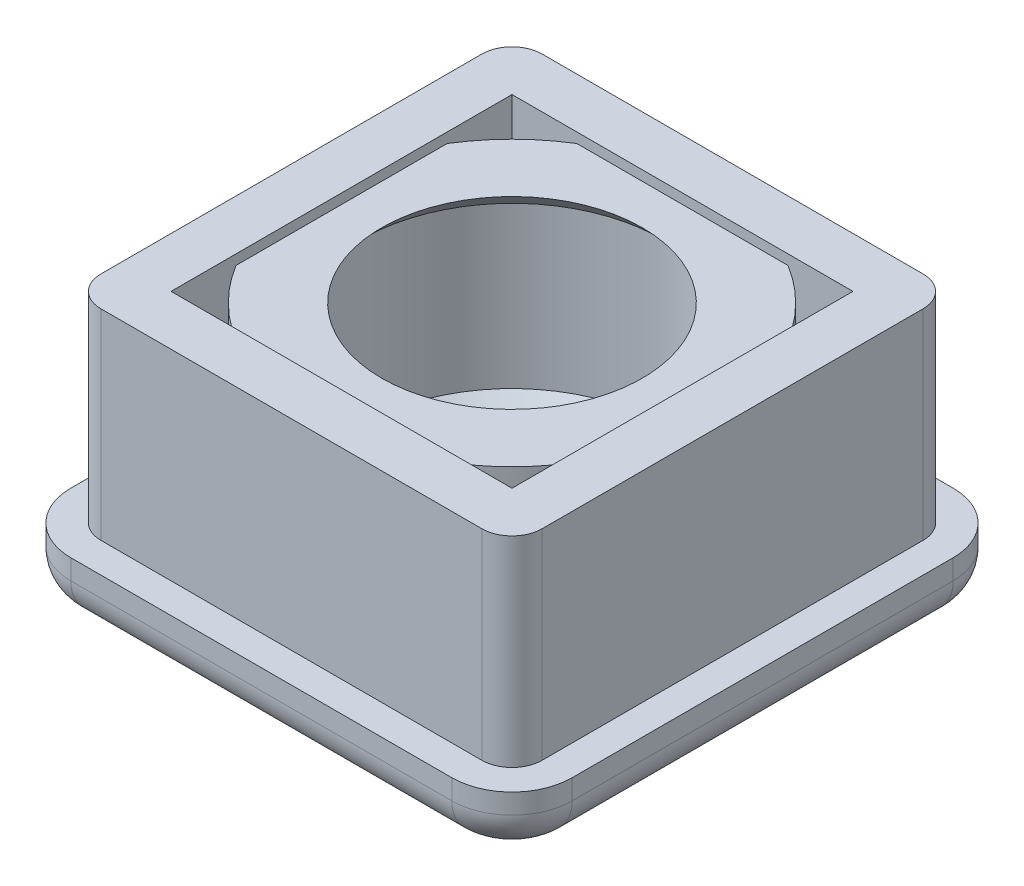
ISO-10303-21;
HEADER;
FILE_DESCRIPTION(('STEP AP214'),'2;1');
FILE_NAME('part.step','',(''),(''),'','','');
FILE_SCHEMA(('AUTOMOTIVE_DESIGN { 1 0 10303 214 1 1 1 1 }'));
ENDSEC;
DATA;
#1=APPLICATION_CONTEXT('core data for automotive mechanical design processes');
#2=APPLICATION_PROTOCOL_DEFINITION('international standard','automotive_design',2000,#1);
#3=PRODUCT_CONTEXT('',#1,'mechanical');
#4=PRODUCT('Part','Part','',(#3));
#5=PRODUCT_RELATED_PRODUCT_CATEGORY('part','',(#4));
#6=PRODUCT_DEFINITION_FORMATION('','',#4);
#7=PRODUCT_DEFINITION_CONTEXT('part definition',#1,'design');
#8=PRODUCT_DEFINITION('design','',#6,#7);
#9=PRODUCT_DEFINITION_SHAPE('','',#8);
#10=(LENGTH_UNIT() NAMED_UNIT(*) SI_UNIT(.MILLI.,.METRE.));
#11=(NAMED_UNIT(*) PLANE_ANGLE_UNIT() SI_UNIT($,.RADIAN.));
#12=(NAMED_UNIT(*) SI_UNIT($,.STERADIAN.) SOLID_ANGLE_UNIT());
#13=UNCERTAINTY_MEASURE_WITH_UNIT(LENGTH_MEASURE(1.E-05),#10,'distance_accuracy_value','');
#14=(GEOMETRIC_REPRESENTATION_CONTEXT(3) GLOBAL_UNCERTAINTY_ASSIGNED_CONTEXT((#13)) GLOBAL_UNIT_ASSIGNED_CONTEXT((#10,
#11,#12)) REPRESENTATION_CONTEXT('',''));
#15=CARTESIAN_POINT('',(0.,0.,0.));
#16=DIRECTION('',(0.,0.,1.));
#17=DIRECTION('',(1.,0.,0.));
#18=AXIS2_PLACEMENT_3D('',#15,#16,#17);
#19=CARTESIAN_POINT('',(0.,12.5,0.));
#20=DIRECTION('',(0.,-1.,0.));
#21=DIRECTION('',(0.,0.,-1.));
#22=AXIS2_PLACEMENT_3D('',#19,#20,#21);
#23=CYLINDRICAL_SURFACE('',#22,7.5);
#24=CARTESIAN_POINT('',(0.,3.5,0.));
#25=DIRECTION('',(0.,1.,0.));
#26=DIRECTION('',(0.,0.,1.));
#27=AXIS2_PLACEMENT_3D('',#24,#25,#26);
#28=CIRCLE('',#27,7.5);
#29=CARTESIAN_POINT('',(0.,3.5,7.5));
#30=VERTEX_POINT('',#29);
#31=EDGE_CURVE('E269',#30,#30,#28,.F.);
#32=ORIENTED_EDGE('',*,*,#31,.T.);
#33=EDGE_LOOP('',(#32));
#34=FACE_BOUND('',#33,.T.);
#35=CARTESIAN_POINT('',(0.,11.5,0.));
#36=DIRECTION('',(0.,1.,0.));
#37=DIRECTION('',(0.,0.,1.));
#38=AXIS2_PLACEMENT_3D('',#35,#36,#37);
#39=CIRCLE('',#38,7.5);
#40=CARTESIAN_POINT('',(0.,11.5,7.5));
#41=VERTEX_POINT('',#40);
#42=EDGE_CURVE('E342',#41,#41,#39,.T.);
#43=ORIENTED_EDGE('',*,*,#42,.T.);
#44=EDGE_LOOP('',(#43));
#45=FACE_BOUND('',#44,.T.);
#46=ADVANCED_FACE('F30',(#34,#45),#23,.F.);
#47=CARTESIAN_POINT('',(9.50000000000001,2.5,9.50000000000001));
#48=DIRECTION('',(0.,1.,0.));
#49=DIRECTION('',(0.,0.,1.));
#50=AXIS2_PLACEMENT_3D('',#47,#48,#49);
#51=PLANE('',#50);
#52=DIRECTION('',(-1.,0.,0.));
#53=VECTOR('',#52,1.);
#54=CARTESIAN_POINT('',(9.50000000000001,2.5,8.5));
#55=LINE('',#54,#53);
#56=CARTESIAN_POINT('',(-5.26782687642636,2.5,8.5));
#57=VERTEX_POINT('',#56);
#58=CARTESIAN_POINT('',(-8.49999999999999,2.5,8.5));
#59=VERTEX_POINT('',#58);
#60=EDGE_CURVE('E399',#57,#59,#55,.T.);
#61=ORIENTED_EDGE('',*,*,#60,.F.);
#62=CARTESIAN_POINT('',(0.,2.5,0.));
#63=DIRECTION('',(0.,1.,0.));
#64=DIRECTION('',(0.,0.,1.));
#65=AXIS2_PLACEMENT_3D('',#62,#63,#64);
#66=CIRCLE('',#65,10.);
#67=CARTESIAN_POINT('',(-8.49999999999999,2.5,5.26782687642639));
#68=VERTEX_POINT('',#67);
#69=EDGE_CURVE('E278',#68,#57,#66,.T.);
#70=ORIENTED_EDGE('',*,*,#69,.F.);
#71=DIRECTION('',(0.,0.,-1.));
#72=VECTOR('',#71,1.);
#73=CARTESIAN_POINT('',(-8.49999999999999,2.5,9.50000000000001));
#74=LINE('',#73,#72);
#75=EDGE_CURVE('E402',#59,#68,#74,.T.);
#76=ORIENTED_EDGE('',*,*,#75,.F.);
#77=EDGE_LOOP('',(#61,#70,#76));
#78=FACE_BOUND('',#77,.T.);
#79=ADVANCED_FACE('F509',(#78),#51,.T.);
#80=CARTESIAN_POINT('',(-8.49999999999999,2.5,-5.26782687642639));
#81=VERTEX_POINT('',#80);
#82=CARTESIAN_POINT('',(-8.49999999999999,2.5,-8.5));
#83=VERTEX_POINT('',#82);
#84=EDGE_CURVE('E401',#81,#83,#74,.T.);
#85=ORIENTED_EDGE('',*,*,#84,.F.);
#86=CARTESIAN_POINT('',(-5.26782687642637,2.5,-8.5));
#87=VERTEX_POINT('',#86);
#88=EDGE_CURVE('E542',#87,#81,#66,.T.);
#89=ORIENTED_EDGE('',*,*,#88,.F.);
#90=DIRECTION('',(1.,0.,0.));
#91=VECTOR('',#90,1.);
#92=CARTESIAN_POINT('',(9.50000000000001,2.5,-8.5));
#93=LINE('',#92,#91);
#94=EDGE_CURVE('E406',#83,#87,#93,.T.);
#95=ORIENTED_EDGE('',*,*,#94,.F.);
#96=EDGE_LOOP('',(#85,#89,#95));
#97=FACE_BOUND('',#96,.T.);
#98=ADVANCED_FACE('F547',(#97),#51,.T.);
#99=CARTESIAN_POINT('',(5.26782687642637,2.5,-8.5));
#100=VERTEX_POINT('',#99);
#101=CARTESIAN_POINT('',(8.50000000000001,2.5,-8.5));
#102=VERTEX_POINT('',#101);
#103=EDGE_CURVE('E405',#100,#102,#93,.T.);
#104=ORIENTED_EDGE('',*,*,#103,.F.);
#105=CARTESIAN_POINT('',(8.50000000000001,2.5,-5.26782687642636));
#106=VERTEX_POINT('',#105);
#107=EDGE_CURVE('E353',#106,#100,#66,.T.);
#108=ORIENTED_EDGE('',*,*,#107,.F.);
#109=DIRECTION('',(0.,0.,1.));
#110=VECTOR('',#109,1.);
#111=CARTESIAN_POINT('',(8.50000000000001,2.5,9.50000000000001));
#112=LINE('',#111,#110);
#113=EDGE_CURVE('E396',#102,#106,#112,.T.);
#114=ORIENTED_EDGE('',*,*,#113,.F.);
#115=EDGE_LOOP('',(#104,#108,#114));
#116=FACE_BOUND('',#115,.T.);
#117=ADVANCED_FACE('F530',(#116),#51,.T.);
#118=CARTESIAN_POINT('',(8.50000000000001,2.5,5.26782687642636));
#119=VERTEX_POINT('',#118);
#120=CARTESIAN_POINT('',(8.50000000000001,2.5,8.5));
#121=VERTEX_POINT('',#120);
#122=EDGE_CURVE('E382',#119,#121,#112,.T.);
#123=ORIENTED_EDGE('',*,*,#122,.F.);
#124=CARTESIAN_POINT('',(5.26782687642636,2.5,8.5));
#125=VERTEX_POINT('',#124);
#126=EDGE_CURVE('E351',#125,#119,#66,.T.);
#127=ORIENTED_EDGE('',*,*,#126,.F.);
#128=EDGE_CURVE('E268',#121,#125,#55,.T.);
#129=ORIENTED_EDGE('',*,*,#128,.F.);
#130=EDGE_LOOP('',(#123,#127,#129));
#131=FACE_BOUND('',#130,.T.);
#132=ADVANCED_FACE('F554',(#131),#51,.T.);
#133=CARTESIAN_POINT('',(8.50000000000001,13.,9.49999999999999));
#134=DIRECTION('',(-1.,0.,0.));
#135=DIRECTION('',(0.,0.,1.));
#136=AXIS2_PLACEMENT_3D('',#133,#134,#135);
#137=PLANE('',#136);
#138=ORIENTED_EDGE('',*,*,#113,.T.);
#139=DIRECTION('',(0.,-1.,0.));
#140=VECTOR('',#139,1.);
#141=CARTESIAN_POINT('',(8.50000000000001,12.5,-5.26782687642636));
#142=LINE('',#141,#140);
#143=CARTESIAN_POINT('',(8.50000000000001,12.5,-5.26782687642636));
#144=VERTEX_POINT('',#143);
#145=EDGE_CURVE('E366',#106,#144,#142,.F.);
#146=ORIENTED_EDGE('',*,*,#145,.T.);
#147=DIRECTION('',(0.,0.,-1.));
#148=VECTOR('',#147,1.);
#149=CARTESIAN_POINT('',(8.50000000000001,12.5,9.49999999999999));
#150=LINE('',#149,#148);
#151=CARTESIAN_POINT('',(8.50000000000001,12.5,5.26782687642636));
#152=VERTEX_POINT('',#151);
#153=EDGE_CURVE('E373',#152,#144,#150,.T.);
#154=ORIENTED_EDGE('',*,*,#153,.F.);
#155=DIRECTION('',(0.,-1.,0.));
#156=VECTOR('',#155,1.);
#157=CARTESIAN_POINT('',(8.50000000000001,12.5,5.26782687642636));
#158=LINE('',#157,#156);
#159=EDGE_CURVE('E260',#152,#119,#158,.T.);
#160=ORIENTED_EDGE('',*,*,#159,.T.);
#161=ORIENTED_EDGE('',*,*,#122,.T.);
#162=DIRECTION('',(0.,-1.,0.));
#163=VECTOR('',#162,1.);
#164=CARTESIAN_POINT('',(8.50000000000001,13.,8.5));
#165=LINE('',#164,#163);
#166=CARTESIAN_POINT('',(8.50000000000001,13.,8.5));
#167=VERTEX_POINT('',#166);
#168=EDGE_CURVE('E379',#167,#121,#165,.T.);
#169=ORIENTED_EDGE('',*,*,#168,.F.);
#170=DIRECTION('',(0.,0.,-1.));
#171=VECTOR('',#170,1.);
#172=CARTESIAN_POINT('',(8.50000000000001,13.,9.49999999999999));
#173=LINE('',#172,#171);
#174=CARTESIAN_POINT('',(8.50000000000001,13.,-8.5));
#175=VERTEX_POINT('',#174);
#176=EDGE_CURVE('E375',#167,#175,#173,.T.);
#177=ORIENTED_EDGE('',*,*,#176,.T.);
#178=DIRECTION('',(0.,-1.,0.));
#179=VECTOR('',#178,1.);
#180=CARTESIAN_POINT('',(8.50000000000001,13.,-8.5));
#181=LINE('',#180,#179);
#182=EDGE_CURVE('E376',#175,#102,#181,.T.);
#183=ORIENTED_EDGE('',*,*,#182,.T.);
#184=EDGE_LOOP('',(#138,#146,#154,#160,#161,#169,#177,#183));
#185=FACE_BOUND('',#184,.T.);
#186=ADVANCED_FACE('F522',(#185),#137,.T.);
#187=CARTESIAN_POINT('',(9.5,13.,-8.5));
#188=DIRECTION('',(0.,0.,1.));
#189=DIRECTION('',(1.,0.,0.));
#190=AXIS2_PLACEMENT_3D('',#187,#188,#189);
#191=PLANE('',#190);
#192=ORIENTED_EDGE('',*,*,#94,.T.);
#193=DIRECTION('',(0.,-1.,0.));
#194=VECTOR('',#193,1.);
#195=CARTESIAN_POINT('',(-5.26782687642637,12.5,-8.5));
#196=LINE('',#195,#194);
#197=CARTESIAN_POINT('',(-5.26782687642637,12.5,-8.5));
#198=VERTEX_POINT('',#197);
#199=EDGE_CURVE('E362',#87,#198,#196,.F.);
#200=ORIENTED_EDGE('',*,*,#199,.T.);
#201=DIRECTION('',(-1.,0.,0.));
#202=VECTOR('',#201,1.);
#203=CARTESIAN_POINT('',(9.5,12.5,-8.5));
#204=LINE('',#203,#202);
#205=CARTESIAN_POINT('',(5.26782687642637,12.5,-8.5));
#206=VERTEX_POINT('',#205);
#207=EDGE_CURVE('E371',#206,#198,#204,.T.);
#208=ORIENTED_EDGE('',*,*,#207,.F.);
#209=DIRECTION('',(0.,-1.,0.));
#210=VECTOR('',#209,1.);
#211=CARTESIAN_POINT('',(5.26782687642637,12.5,-8.5));
#212=LINE('',#211,#210);
#213=EDGE_CURVE('E359',#206,#100,#212,.T.);
#214=ORIENTED_EDGE('',*,*,#213,.T.);
#215=ORIENTED_EDGE('',*,*,#103,.T.);
#216=ORIENTED_EDGE('',*,*,#182,.F.);
#217=DIRECTION('',(-1.,0.,0.));
#218=VECTOR('',#217,1.);
#219=CARTESIAN_POINT('',(9.5,13.,-8.5));
#220=LINE('',#219,#218);
#221=CARTESIAN_POINT('',(-8.49999999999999,13.,-8.5));
#222=VERTEX_POINT('',#221);
#223=EDGE_CURVE('E390',#175,#222,#220,.T.);
#224=ORIENTED_EDGE('',*,*,#223,.T.);
#225=DIRECTION('',(0.,-1.,0.));
#226=VECTOR('',#225,1.);
#227=CARTESIAN_POINT('',(-8.49999999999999,13.,-8.5));
#228=LINE('',#227,#226);
#229=EDGE_CURVE('E380',#222,#83,#228,.T.);
#230=ORIENTED_EDGE('',*,*,#229,.T.);
#231=EDGE_LOOP('',(#192,#200,#208,#214,#215,#216,#224,#230));
#232=FACE_BOUND('',#231,.T.);
#233=ADVANCED_FACE('F524',(#232),#191,.T.);
#234=CARTESIAN_POINT('',(-8.49999999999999,13.,-9.49999999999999));
#235=DIRECTION('',(1.,0.,0.));
#236=DIRECTION('',(0.,0.,-1.));
#237=AXIS2_PLACEMENT_3D('',#234,#235,#236);
#238=PLANE('',#237);
#239=ORIENTED_EDGE('',*,*,#75,.T.);
#240=DIRECTION('',(0.,-1.,0.));
#241=VECTOR('',#240,1.);
#242=CARTESIAN_POINT('',(-8.49999999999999,12.5,5.26782687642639));
#243=LINE('',#242,#241);
#244=CARTESIAN_POINT('',(-8.49999999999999,12.5,5.26782687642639));
#245=VERTEX_POINT('',#244);
#246=EDGE_CURVE('E356',#68,#245,#243,.F.);
#247=ORIENTED_EDGE('',*,*,#246,.T.);
#248=DIRECTION('',(0.,0.,1.));
#249=VECTOR('',#248,1.);
#250=CARTESIAN_POINT('',(-8.49999999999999,12.5,-9.49999999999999));
#251=LINE('',#250,#249);
#252=CARTESIAN_POINT('',(-8.49999999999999,12.5,-5.26782687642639));
#253=VERTEX_POINT('',#252);
#254=EDGE_CURVE('E369',#253,#245,#251,.T.);
#255=ORIENTED_EDGE('',*,*,#254,.F.);
#256=DIRECTION('',(0.,-1.,0.));
#257=VECTOR('',#256,1.);
#258=CARTESIAN_POINT('',(-8.49999999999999,12.5,-5.26782687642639));
#259=LINE('',#258,#257);
#260=EDGE_CURVE('E261',#253,#81,#259,.T.);
#261=ORIENTED_EDGE('',*,*,#260,.T.);
#262=ORIENTED_EDGE('',*,*,#84,.T.);
#263=ORIENTED_EDGE('',*,*,#229,.F.);
#264=DIRECTION('',(0.,0.,1.));
#265=VECTOR('',#264,1.);
#266=CARTESIAN_POINT('',(-8.49999999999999,13.,-9.49999999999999));
#267=LINE('',#266,#265);
#268=CARTESIAN_POINT('',(-8.49999999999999,13.,8.5));
#269=VERTEX_POINT('',#268);
#270=EDGE_CURVE('E393',#222,#269,#267,.T.);
#271=ORIENTED_EDGE('',*,*,#270,.T.);
#272=DIRECTION('',(0.,-1.,0.));
#273=VECTOR('',#272,1.);
#274=CARTESIAN_POINT('',(-8.49999999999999,13.,8.5));
#275=LINE('',#274,#273);
#276=EDGE_CURVE('E385',#269,#59,#275,.T.);
#277=ORIENTED_EDGE('',*,*,#276,.T.);
#278=EDGE_LOOP('',(#239,#247,#255,#261,#262,#263,#271,#277));
#279=FACE_BOUND('',#278,.T.);
#280=ADVANCED_FACE('F511',(#279),#238,.T.);
#281=CARTESIAN_POINT('',(-9.49999999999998,13.,8.5));
#282=DIRECTION('',(0.,0.,-1.));
#283=DIRECTION('',(-1.,0.,0.));
#284=AXIS2_PLACEMENT_3D('',#281,#282,#283);
#285=PLANE('',#284);
#286=ORIENTED_EDGE('',*,*,#128,.T.);
#287=DIRECTION('',(0.,-1.,0.));
#288=VECTOR('',#287,1.);
#289=CARTESIAN_POINT('',(5.26782687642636,12.5,8.5));
#290=LINE('',#289,#288);
#291=CARTESIAN_POINT('',(5.26782687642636,12.5,8.5));
#292=VERTEX_POINT('',#291);
#293=EDGE_CURVE('E253',#125,#292,#290,.F.);
#294=ORIENTED_EDGE('',*,*,#293,.T.);
#295=DIRECTION('',(1.,0.,0.));
#296=VECTOR('',#295,1.);
#297=CARTESIAN_POINT('',(-9.49999999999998,12.5,8.5));
#298=LINE('',#297,#296);
#299=CARTESIAN_POINT('',(-5.26782687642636,12.5,8.5));
#300=VERTEX_POINT('',#299);
#301=EDGE_CURVE('E242',#300,#292,#298,.T.);
#302=ORIENTED_EDGE('',*,*,#301,.F.);
#303=DIRECTION('',(0.,-1.,0.));
#304=VECTOR('',#303,1.);
#305=CARTESIAN_POINT('',(-5.26782687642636,12.5,8.5));
#306=LINE('',#305,#304);
#307=EDGE_CURVE('E254',#300,#57,#306,.T.);
#308=ORIENTED_EDGE('',*,*,#307,.T.);
#309=ORIENTED_EDGE('',*,*,#60,.T.);
#310=ORIENTED_EDGE('',*,*,#276,.F.);
#311=DIRECTION('',(1.,0.,0.));
#312=VECTOR('',#311,1.);
#313=CARTESIAN_POINT('',(-9.49999999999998,13.,8.5));
#314=LINE('',#313,#312);
#315=EDGE_CURVE('E388',#269,#167,#314,.T.);
#316=ORIENTED_EDGE('',*,*,#315,.T.);
#317=ORIENTED_EDGE('',*,*,#168,.T.);
#318=EDGE_LOOP('',(#286,#294,#302,#308,#309,#310,#316,#317));
#319=FACE_BOUND('',#318,.T.);
#320=ADVANCED_FACE('F265',(#319),#285,.T.);
#321=CARTESIAN_POINT('',(9.50000000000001,3.,9.50000000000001));
#322=DIRECTION('',(0.,1.,0.));
#323=DIRECTION('',(0.,0.,1.));
#324=AXIS2_PLACEMENT_3D('',#321,#322,#323);
#325=PLANE('',#324);
#326=CARTESIAN_POINT('',(9.50000000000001,3.,9.50000000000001));
#327=DIRECTION('',(0.,1.,0.));
#328=DIRECTION('',(0.,0.,1.));
#329=AXIS2_PLACEMENT_3D('',#326,#327,#328);
#330=CIRCLE('',#329,3.);
#331=CARTESIAN_POINT('',(9.49999999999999,3.,12.5));
#332=VERTEX_POINT('',#331);
#333=CARTESIAN_POINT('',(12.5,3.,9.49999999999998));
#334=VERTEX_POINT('',#333);
#335=EDGE_CURVE('E466',#332,#334,#330,.T.);
#336=ORIENTED_EDGE('',*,*,#335,.T.);
#337=DIRECTION('',(0.,0.,-1.));
#338=VECTOR('',#337,1.);
#339=CARTESIAN_POINT('',(12.5,3.,9.49999999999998));
#340=LINE('',#339,#338);
#341=CARTESIAN_POINT('',(12.5,3.,-9.49999999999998));
#342=VERTEX_POINT('',#341);
#343=EDGE_CURVE('E469',#334,#342,#340,.T.);
#344=ORIENTED_EDGE('',*,*,#343,.T.);
#345=CARTESIAN_POINT('',(9.50000000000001,3.,-9.5));
#346=DIRECTION('',(0.,1.,0.));
#347=DIRECTION('',(0.,0.,-1.));
#348=AXIS2_PLACEMENT_3D('',#345,#346,#347);
#349=CIRCLE('',#348,3.);
#350=CARTESIAN_POINT('',(9.49999999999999,3.,-12.5));
#351=VERTEX_POINT('',#350);
#352=EDGE_CURVE('E471',#342,#351,#349,.T.);
#353=ORIENTED_EDGE('',*,*,#352,.T.);
#354=DIRECTION('',(-1.,0.,0.));
#355=VECTOR('',#354,1.);
#356=CARTESIAN_POINT('',(-9.49999999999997,3.,-12.5));
#357=LINE('',#356,#355);
#358=CARTESIAN_POINT('',(-9.49999999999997,3.,-12.5));
#359=VERTEX_POINT('',#358);
#360=EDGE_CURVE('E473',#351,#359,#357,.T.);
#361=ORIENTED_EDGE('',*,*,#360,.T.);
#362=CARTESIAN_POINT('',(-9.49999999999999,3.,-9.5));
#363=DIRECTION('',(0.,1.,0.));
#364=DIRECTION('',(0.,0.,-1.));
#365=AXIS2_PLACEMENT_3D('',#362,#363,#364);
#366=CIRCLE('',#365,3.);
#367=CARTESIAN_POINT('',(-12.5,3.,-9.49999999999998));
#368=VERTEX_POINT('',#367);
#369=EDGE_CURVE('E475',#359,#368,#366,.T.);
#370=ORIENTED_EDGE('',*,*,#369,.T.);
#371=DIRECTION('',(0.,0.,1.));
#372=VECTOR('',#371,1.);
#373=CARTESIAN_POINT('',(-12.5,3.,9.49999999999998));
#374=LINE('',#373,#372);
#375=CARTESIAN_POINT('',(-12.5,3.,9.49999999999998));
#376=VERTEX_POINT('',#375);
#377=EDGE_CURVE('E477',#368,#376,#374,.T.);
#378=ORIENTED_EDGE('',*,*,#377,.T.);
#379=CARTESIAN_POINT('',(-9.49999999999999,3.,9.50000000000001));
#380=DIRECTION('',(0.,1.,0.));
#381=DIRECTION('',(0.,0.,-1.));
#382=AXIS2_PLACEMENT_3D('',#379,#380,#381);
#383=CIRCLE('',#382,3.);
#384=CARTESIAN_POINT('',(-9.49999999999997,3.,12.5));
#385=VERTEX_POINT('',#384);
#386=EDGE_CURVE('E479',#376,#385,#383,.T.);
#387=ORIENTED_EDGE('',*,*,#386,.T.);
#388=DIRECTION('',(1.,0.,0.));
#389=VECTOR('',#388,1.);
#390=CARTESIAN_POINT('',(-9.49999999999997,3.,12.5));
#391=LINE('',#390,#389);
#392=EDGE_CURVE('E481',#385,#332,#391,.T.);
#393=ORIENTED_EDGE('',*,*,#392,.T.);
#394=EDGE_LOOP('',(#336,#344,#353,#361,#370,#378,#387,#393));
#395=FACE_BOUND('',#394,.T.);
#396=DIRECTION('',(0.,0.,-1.));
#397=VECTOR('',#396,1.);
#398=CARTESIAN_POINT('',(11.,3.,9.49999999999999));
#399=LINE('',#398,#397);
#400=CARTESIAN_POINT('',(11.,3.,9.49999999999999));
#401=VERTEX_POINT('',#400);
#402=CARTESIAN_POINT('',(11.,3.,-9.49999999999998));
#403=VERTEX_POINT('',#402);
#404=EDGE_CURVE('E431',#401,#403,#399,.T.);
#405=ORIENTED_EDGE('',*,*,#404,.F.);
#406=CARTESIAN_POINT('',(9.50000000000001,3.,9.50000000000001));
#407=DIRECTION('',(0.,1.,0.));
#408=DIRECTION('',(0.,0.,1.));
#409=AXIS2_PLACEMENT_3D('',#406,#407,#408);
#410=CIRCLE('',#409,1.5);
#411=CARTESIAN_POINT('',(9.5,3.,11.));
#412=VERTEX_POINT('',#411);
#413=EDGE_CURVE('E409',#412,#401,#410,.T.);
#414=ORIENTED_EDGE('',*,*,#413,.F.);
#415=DIRECTION('',(1.,0.,0.));
#416=VECTOR('',#415,1.);
#417=CARTESIAN_POINT('',(-9.49999999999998,3.,11.));
#418=LINE('',#417,#416);
#419=CARTESIAN_POINT('',(-9.49999999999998,3.,11.));
#420=VERTEX_POINT('',#419);
#421=EDGE_CURVE('E414',#420,#412,#418,.T.);
#422=ORIENTED_EDGE('',*,*,#421,.F.);
#423=CARTESIAN_POINT('',(-9.49999999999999,3.,9.50000000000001));
#424=DIRECTION('',(0.,1.,0.));
#425=DIRECTION('',(0.,0.,1.));
#426=AXIS2_PLACEMENT_3D('',#423,#424,#425);
#427=CIRCLE('',#426,1.5);
#428=CARTESIAN_POINT('',(-11.,3.,9.49999999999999));
#429=VERTEX_POINT('',#428);
#430=EDGE_CURVE('E441',#429,#420,#427,.T.);
#431=ORIENTED_EDGE('',*,*,#430,.F.);
#432=DIRECTION('',(0.,0.,1.));
#433=VECTOR('',#432,1.);
#434=CARTESIAN_POINT('',(-11.,3.,-9.49999999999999));
#435=LINE('',#434,#433);
#436=CARTESIAN_POINT('',(-11.,3.,-9.49999999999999));
#437=VERTEX_POINT('',#436);
#438=EDGE_CURVE('E439',#437,#429,#435,.T.);
#439=ORIENTED_EDGE('',*,*,#438,.F.);
#440=CARTESIAN_POINT('',(-9.49999999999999,3.,-9.5));
#441=DIRECTION('',(0.,1.,0.));
#442=DIRECTION('',(0.,0.,1.));
#443=AXIS2_PLACEMENT_3D('',#440,#441,#442);
#444=CIRCLE('',#443,1.5);
#445=CARTESIAN_POINT('',(-9.49999999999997,3.,-11.));
#446=VERTEX_POINT('',#445);
#447=EDGE_CURVE('E437',#446,#437,#444,.T.);
#448=ORIENTED_EDGE('',*,*,#447,.F.);
#449=DIRECTION('',(-1.,0.,0.));
#450=VECTOR('',#449,1.);
#451=CARTESIAN_POINT('',(9.5,3.,-11.));
#452=LINE('',#451,#450);
#453=CARTESIAN_POINT('',(9.5,3.,-11.));
#454=VERTEX_POINT('',#453);
#455=EDGE_CURVE('E435',#454,#446,#452,.T.);
#456=ORIENTED_EDGE('',*,*,#455,.F.);
#457=CARTESIAN_POINT('',(9.50000000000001,3.,-9.5));
#458=DIRECTION('',(0.,1.,0.));
#459=DIRECTION('',(0.,0.,1.));
#460=AXIS2_PLACEMENT_3D('',#457,#458,#459);
#461=CIRCLE('',#460,1.5);
#462=EDGE_CURVE('E433',#403,#454,#461,.T.);
#463=ORIENTED_EDGE('',*,*,#462,.F.);
#464=EDGE_LOOP('',(#405,#414,#422,#431,#439,#448,#456,#463));
#465=FACE_BOUND('',#464,.T.);
#466=ADVANCED_FACE('F728',(#395,#465),#325,.T.);
#467=CARTESIAN_POINT('',(9.50000000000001,3.,9.50000000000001));
#468=DIRECTION('',(0.,-1.,0.));
#469=DIRECTION('',(0.,0.,-1.));
#470=AXIS2_PLACEMENT_3D('',#467,#468,#469);
#471=CYLINDRICAL_SURFACE('',#470,3.);
#472=DIRECTION('',(0.,-1.,0.));
#473=VECTOR('',#472,1.);
#474=CARTESIAN_POINT('',(9.49999999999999,3.,12.5));
#475=LINE('',#474,#473);
#476=CARTESIAN_POINT('',(9.49999999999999,2.,12.5));
#477=VERTEX_POINT('',#476);
#478=EDGE_CURVE('E483',#332,#477,#475,.T.);
#479=ORIENTED_EDGE('',*,*,#478,.T.);
#480=CARTESIAN_POINT('',(9.50000000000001,2.,9.50000000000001));
#481=DIRECTION('',(0.,1.,0.));
#482=DIRECTION('',(0.,0.,1.));
#483=AXIS2_PLACEMENT_3D('',#480,#481,#482);
#484=CIRCLE('',#483,3.);
#485=CARTESIAN_POINT('',(12.5,2.,9.49999999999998));
#486=VERTEX_POINT('',#485);
#487=EDGE_CURVE('E39',#477,#486,#484,.T.);
#488=ORIENTED_EDGE('',*,*,#487,.T.);
#489=DIRECTION('',(0.,-1.,0.));
#490=VECTOR('',#489,1.);
#491=CARTESIAN_POINT('',(12.5,3.,9.49999999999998));
#492=LINE('',#491,#490);
#493=EDGE_CURVE('E502',#334,#486,#492,.T.);
#494=ORIENTED_EDGE('',*,*,#493,.F.);
#495=ORIENTED_EDGE('',*,*,#335,.F.);
#496=EDGE_LOOP('',(#479,#488,#494,#495));
#497=FACE_BOUND('',#496,.T.);
#498=ADVANCED_FACE('F720',(#497),#471,.T.);
#499=CARTESIAN_POINT('',(12.5,3.,9.49999999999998));
#500=DIRECTION('',(-1.,0.,0.));
#501=DIRECTION('',(0.,0.,1.));
#502=AXIS2_PLACEMENT_3D('',#499,#500,#501);
#503=PLANE('',#502);
#504=ORIENTED_EDGE('',*,*,#493,.T.);
#505=DIRECTION('',(0.,0.,-1.));
#506=VECTOR('',#505,1.);
#507=CARTESIAN_POINT('',(12.5,2.,9.49999999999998));
#508=LINE('',#507,#506);
#509=CARTESIAN_POINT('',(12.5,2.,-9.49999999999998));
#510=VERTEX_POINT('',#509);
#511=EDGE_CURVE('E311',#486,#510,#508,.T.);
#512=ORIENTED_EDGE('',*,*,#511,.T.);
#513=DIRECTION('',(0.,-1.,0.));
#514=VECTOR('',#513,1.);
#515=CARTESIAN_POINT('',(12.5,3.,-9.49999999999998));
#516=LINE('',#515,#514);
#517=EDGE_CURVE('E499',#342,#510,#516,.T.);
#518=ORIENTED_EDGE('',*,*,#517,.F.);
#519=ORIENTED_EDGE('',*,*,#343,.F.);
#520=EDGE_LOOP('',(#504,#512,#518,#519));
#521=FACE_BOUND('',#520,.T.);
#522=ADVANCED_FACE('F712',(#521),#503,.F.);
#523=CARTESIAN_POINT('',(9.50000000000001,3.,-9.5));
#524=DIRECTION('',(0.,-1.,0.));
#525=DIRECTION('',(0.,0.,-1.));
#526=AXIS2_PLACEMENT_3D('',#523,#524,#525);
#527=CYLINDRICAL_SURFACE('',#526,3.);
#528=ORIENTED_EDGE('',*,*,#517,.T.);
#529=CARTESIAN_POINT('',(9.50000000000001,2.,-9.5));
#530=DIRECTION('',(0.,1.,0.));
#531=DIRECTION('',(0.,0.,1.));
#532=AXIS2_PLACEMENT_3D('',#529,#530,#531);
#533=CIRCLE('',#532,3.);
#534=CARTESIAN_POINT('',(9.49999999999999,2.,-12.5));
#535=VERTEX_POINT('',#534);
#536=EDGE_CURVE('E309',#510,#535,#533,.T.);
#537=ORIENTED_EDGE('',*,*,#536,.T.);
#538=DIRECTION('',(0.,-1.,0.));
#539=VECTOR('',#538,1.);
#540=CARTESIAN_POINT('',(9.49999999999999,3.,-12.5));
#541=LINE('',#540,#539);
#542=EDGE_CURVE('E496',#351,#535,#541,.T.);
#543=ORIENTED_EDGE('',*,*,#542,.F.);
#544=ORIENTED_EDGE('',*,*,#352,.F.);
#545=EDGE_LOOP('',(#528,#537,#543,#544));
#546=FACE_BOUND('',#545,.T.);
#547=ADVANCED_FACE('F704',(#546),#527,.T.);
#548=CARTESIAN_POINT('',(-9.49999999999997,3.,-12.5));
#549=DIRECTION('',(0.,0.,1.));
#550=DIRECTION('',(1.,0.,0.));
#551=AXIS2_PLACEMENT_3D('',#548,#549,#550);
#552=PLANE('',#551);
#553=ORIENTED_EDGE('',*,*,#542,.T.);
#554=DIRECTION('',(-1.,0.,0.));
#555=VECTOR('',#554,1.);
#556=CARTESIAN_POINT('',(-9.49999999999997,2.,-12.5));
#557=LINE('',#556,#555);
#558=CARTESIAN_POINT('',(-9.49999999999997,2.,-12.5));
#559=VERTEX_POINT('',#558);
#560=EDGE_CURVE('E307',#535,#559,#557,.T.);
#561=ORIENTED_EDGE('',*,*,#560,.T.);
#562=DIRECTION('',(0.,-1.,0.));
#563=VECTOR('',#562,1.);
#564=CARTESIAN_POINT('',(-9.49999999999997,3.,-12.5));
#565=LINE('',#564,#563);
#566=EDGE_CURVE('E493',#359,#559,#565,.T.);
#567=ORIENTED_EDGE('',*,*,#566,.F.);
#568=ORIENTED_EDGE('',*,*,#360,.F.);
#569=EDGE_LOOP('',(#553,#561,#567,#568));
#570=FACE_BOUND('',#569,.T.);
#571=ADVANCED_FACE('F696',(#570),#552,.F.);
#572=CARTESIAN_POINT('',(-9.49999999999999,3.,-9.5));
#573=DIRECTION('',(0.,-1.,0.));
#574=DIRECTION('',(0.,0.,-1.));
#575=AXIS2_PLACEMENT_3D('',#572,#573,#574);
#576=CYLINDRICAL_SURFACE('',#575,3.);
#577=ORIENTED_EDGE('',*,*,#566,.T.);
#578=CARTESIAN_POINT('',(-9.49999999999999,2.,-9.5));
#579=DIRECTION('',(0.,1.,0.));
#580=DIRECTION('',(0.,0.,1.));
#581=AXIS2_PLACEMENT_3D('',#578,#579,#580);
#582=CIRCLE('',#581,3.);
#583=CARTESIAN_POINT('',(-12.5,2.,-9.49999999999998));
#584=VERTEX_POINT('',#583);
#585=EDGE_CURVE('E305',#559,#584,#582,.T.);
#586=ORIENTED_EDGE('',*,*,#585,.T.);
#587=DIRECTION('',(0.,-1.,0.));
#588=VECTOR('',#587,1.);
#589=CARTESIAN_POINT('',(-12.5,3.,-9.49999999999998));
#590=LINE('',#589,#588);
#591=EDGE_CURVE('E490',#368,#584,#590,.T.);
#592=ORIENTED_EDGE('',*,*,#591,.F.);
#593=ORIENTED_EDGE('',*,*,#369,.F.);
#594=EDGE_LOOP('',(#577,#586,#592,#593));
#595=FACE_BOUND('',#594,.T.);
#596=ADVANCED_FACE('F688',(#595),#576,.T.);
#597=CARTESIAN_POINT('',(-12.5,3.,9.49999999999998));
#598=DIRECTION('',(1.,0.,0.));
#599=DIRECTION('',(0.,0.,-1.));
#600=AXIS2_PLACEMENT_3D('',#597,#598,#599);
#601=PLANE('',#600);
#602=ORIENTED_EDGE('',*,*,#591,.T.);
#603=DIRECTION('',(0.,0.,1.));
#604=VECTOR('',#603,1.);
#605=CARTESIAN_POINT('',(-12.5,2.,9.49999999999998));
#606=LINE('',#605,#604);
#607=CARTESIAN_POINT('',(-12.5,2.,9.49999999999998));
#608=VERTEX_POINT('',#607);
#609=EDGE_CURVE('E303',#584,#608,#606,.T.);
#610=ORIENTED_EDGE('',*,*,#609,.T.);
#611=DIRECTION('',(0.,-1.,0.));
#612=VECTOR('',#611,1.);
#613=CARTESIAN_POINT('',(-12.5,3.,9.49999999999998));
#614=LINE('',#613,#612);
#615=EDGE_CURVE('E487',#376,#608,#614,.T.);
#616=ORIENTED_EDGE('',*,*,#615,.F.);
#617=ORIENTED_EDGE('',*,*,#377,.F.);
#618=EDGE_LOOP('',(#602,#610,#616,#617));
#619=FACE_BOUND('',#618,.T.);
#620=ADVANCED_FACE('F680',(#619),#601,.F.);
#621=CARTESIAN_POINT('',(-9.49999999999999,3.,9.50000000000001));
#622=DIRECTION('',(0.,-1.,0.));
#623=DIRECTION('',(0.,0.,-1.));
#624=AXIS2_PLACEMENT_3D('',#621,#622,#623);
#625=CYLINDRICAL_SURFACE('',#624,3.);
#626=ORIENTED_EDGE('',*,*,#615,.T.);
#627=CARTESIAN_POINT('',(-9.49999999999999,2.,9.50000000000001));
#628=DIRECTION('',(0.,1.,0.));
#629=DIRECTION('',(0.,0.,1.));
#630=AXIS2_PLACEMENT_3D('',#627,#628,#629);
#631=CIRCLE('',#630,3.);
#632=CARTESIAN_POINT('',(-9.49999999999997,2.,12.5));
#633=VERTEX_POINT('',#632);
#634=EDGE_CURVE('E283',#608,#633,#631,.T.);
#635=ORIENTED_EDGE('',*,*,#634,.T.);
#636=DIRECTION('',(0.,-1.,0.));
#637=VECTOR('',#636,1.);
#638=CARTESIAN_POINT('',(-9.49999999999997,3.,12.5));
#639=LINE('',#638,#637);
#640=EDGE_CURVE('E485',#385,#633,#639,.T.);
#641=ORIENTED_EDGE('',*,*,#640,.F.);
#642=ORIENTED_EDGE('',*,*,#386,.F.);
#643=EDGE_LOOP('',(#626,#635,#641,#642));
#644=FACE_BOUND('',#643,.T.);
#645=ADVANCED_FACE('F673',(#644),#625,.T.);
#646=CARTESIAN_POINT('',(-9.49999999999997,3.,12.5));
#647=DIRECTION('',(0.,0.,-1.));
#648=DIRECTION('',(-1.,0.,0.));
#649=AXIS2_PLACEMENT_3D('',#646,#647,#648);
#650=PLANE('',#649);
#651=ORIENTED_EDGE('',*,*,#640,.T.);
#652=DIRECTION('',(1.,0.,0.));
#653=VECTOR('',#652,1.);
#654=CARTESIAN_POINT('',(-9.49999999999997,2.,12.5));
#655=LINE('',#654,#653);
#656=EDGE_CURVE('E11',#633,#477,#655,.T.);
#657=ORIENTED_EDGE('',*,*,#656,.T.);
#658=ORIENTED_EDGE('',*,*,#478,.F.);
#659=ORIENTED_EDGE('',*,*,#392,.F.);
#660=EDGE_LOOP('',(#651,#657,#658,#659));
#661=FACE_BOUND('',#660,.T.);
#662=ADVANCED_FACE('F664',(#661),#650,.F.);
#663=CARTESIAN_POINT('',(9.50000000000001,0.,9.50000000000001));
#664=DIRECTION('',(0.,1.,0.));
#665=DIRECTION('',(0.,0.,1.));
#666=AXIS2_PLACEMENT_3D('',#663,#664,#665);
#667=PLANE('',#666);
#668=DIRECTION('',(1.,0.,0.));
#669=VECTOR('',#668,1.);
#670=CARTESIAN_POINT('',(9.50000000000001,0.,10.5));
#671=LINE('',#670,#669);
#672=CARTESIAN_POINT('',(9.5,0.,10.5));
#673=VERTEX_POINT('',#672);
#674=CARTESIAN_POINT('',(-9.49999999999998,0.,10.5));
#675=VERTEX_POINT('',#674);
#676=EDGE_CURVE('E286',#673,#675,#671,.F.);
#677=ORIENTED_EDGE('',*,*,#676,.T.);
#678=CARTESIAN_POINT('',(-9.49999999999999,0.,9.50000000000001));
#679=DIRECTION('',(0.,1.,0.));
#680=DIRECTION('',(0.,0.,1.));
#681=AXIS2_PLACEMENT_3D('',#678,#679,#680);
#682=CIRCLE('',#681,1.);
#683=CARTESIAN_POINT('',(-10.5,0.,9.5));
#684=VERTEX_POINT('',#683);
#685=EDGE_CURVE('E300',#675,#684,#682,.F.);
#686=ORIENTED_EDGE('',*,*,#685,.T.);
#687=DIRECTION('',(0.,0.,1.));
#688=VECTOR('',#687,1.);
#689=CARTESIAN_POINT('',(-10.5,0.,9.50000000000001));
#690=LINE('',#689,#688);
#691=CARTESIAN_POINT('',(-10.5,0.,-9.49999999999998));
#692=VERTEX_POINT('',#691);
#693=EDGE_CURVE('E298',#684,#692,#690,.F.);
#694=ORIENTED_EDGE('',*,*,#693,.T.);
#695=CARTESIAN_POINT('',(-9.49999999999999,0.,-9.5));
#696=DIRECTION('',(0.,1.,0.));
#697=DIRECTION('',(0.,0.,1.));
#698=AXIS2_PLACEMENT_3D('',#695,#696,#697);
#699=CIRCLE('',#698,1.);
#700=CARTESIAN_POINT('',(-9.49999999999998,0.,-10.5));
#701=VERTEX_POINT('',#700);
#702=EDGE_CURVE('E296',#692,#701,#699,.F.);
#703=ORIENTED_EDGE('',*,*,#702,.T.);
#704=DIRECTION('',(-1.,0.,0.));
#705=VECTOR('',#704,1.);
#706=CARTESIAN_POINT('',(9.50000000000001,0.,-10.5));
#707=LINE('',#706,#705);
#708=CARTESIAN_POINT('',(9.49999999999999,0.,-10.5));
#709=VERTEX_POINT('',#708);
#710=EDGE_CURVE('E294',#701,#709,#707,.F.);
#711=ORIENTED_EDGE('',*,*,#710,.T.);
#712=CARTESIAN_POINT('',(9.50000000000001,0.,-9.5));
#713=DIRECTION('',(0.,1.,0.));
#714=DIRECTION('',(0.,0.,1.));
#715=AXIS2_PLACEMENT_3D('',#712,#713,#714);
#716=CIRCLE('',#715,1.);
#717=CARTESIAN_POINT('',(10.5,0.,-9.49999999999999));
#718=VERTEX_POINT('',#717);
#719=EDGE_CURVE('E292',#709,#718,#716,.F.);
#720=ORIENTED_EDGE('',*,*,#719,.T.);
#721=DIRECTION('',(0.,0.,-1.));
#722=VECTOR('',#721,1.);
#723=CARTESIAN_POINT('',(10.5,0.,9.50000000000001));
#724=LINE('',#723,#722);
#725=CARTESIAN_POINT('',(10.5,0.,9.49999999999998));
#726=VERTEX_POINT('',#725);
#727=EDGE_CURVE('E290',#718,#726,#724,.F.);
#728=ORIENTED_EDGE('',*,*,#727,.T.);
#729=CARTESIAN_POINT('',(9.50000000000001,0.,9.50000000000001));
#730=DIRECTION('',(0.,1.,0.));
#731=DIRECTION('',(0.,0.,1.));
#732=AXIS2_PLACEMENT_3D('',#729,#730,#731);
#733=CIRCLE('',#732,1.);
#734=EDGE_CURVE('E288',#726,#673,#733,.F.);
#735=ORIENTED_EDGE('',*,*,#734,.T.);
#736=EDGE_LOOP('',(#677,#686,#694,#703,#711,#720,#728,#735));
#737=FACE_BOUND('',#736,.T.);
#738=CARTESIAN_POINT('',(0.,0.,0.));
#739=DIRECTION('',(0.,-1.,0.));
#740=DIRECTION('',(0.,0.,-1.));
#741=AXIS2_PLACEMENT_3D('',#738,#739,#740);
#742=CIRCLE('',#741,4.);
#743=CARTESIAN_POINT('',(0.,0.,-4.));
#744=VERTEX_POINT('',#743);
#745=EDGE_CURVE('E279',#744,#744,#742,.T.);
#746=ORIENTED_EDGE('',*,*,#745,.F.);
#747=EDGE_LOOP('',(#746));
#748=FACE_BOUND('',#747,.T.);
#749=ADVANCED_FACE('F655',(#737,#748),#667,.F.);
#750=CARTESIAN_POINT('',(9.50000000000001,13.,9.50000000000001));
#751=DIRECTION('',(0.,-1.,0.));
#752=DIRECTION('',(0.,0.,-1.));
#753=AXIS2_PLACEMENT_3D('',#750,#751,#752);
#754=CYLINDRICAL_SURFACE('',#753,1.5);
#755=ORIENTED_EDGE('',*,*,#413,.T.);
#756=DIRECTION('',(0.,-1.,0.));
#757=VECTOR('',#756,1.);
#758=CARTESIAN_POINT('',(11.,13.,9.49999999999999));
#759=LINE('',#758,#757);
#760=CARTESIAN_POINT('',(11.,13.,9.49999999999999));
#761=VERTEX_POINT('',#760);
#762=EDGE_CURVE('E464',#761,#401,#759,.T.);
#763=ORIENTED_EDGE('',*,*,#762,.F.);
#764=CARTESIAN_POINT('',(9.50000000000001,13.,9.50000000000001));
#765=DIRECTION('',(0.,1.,0.));
#766=DIRECTION('',(0.,0.,1.));
#767=AXIS2_PLACEMENT_3D('',#764,#765,#766);
#768=CIRCLE('',#767,1.5);
#769=CARTESIAN_POINT('',(9.5,13.,11.));
#770=VERTEX_POINT('',#769);
#771=EDGE_CURVE('E410',#770,#761,#768,.T.);
#772=ORIENTED_EDGE('',*,*,#771,.F.);
#773=DIRECTION('',(0.,-1.,0.));
#774=VECTOR('',#773,1.);
#775=CARTESIAN_POINT('',(9.5,13.,11.));
#776=LINE('',#775,#774);
#777=EDGE_CURVE('E428',#770,#412,#776,.T.);
#778=ORIENTED_EDGE('',*,*,#777,.T.);
#779=EDGE_LOOP('',(#755,#763,#772,#778));
#780=FACE_BOUND('',#779,.T.);
#781=ADVANCED_FACE('F647',(#780),#754,.T.);
#782=CARTESIAN_POINT('',(11.,13.,9.49999999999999));
#783=DIRECTION('',(-1.,0.,0.));
#784=DIRECTION('',(0.,0.,1.));
#785=AXIS2_PLACEMENT_3D('',#782,#783,#784);
#786=PLANE('',#785);
#787=ORIENTED_EDGE('',*,*,#404,.T.);
#788=DIRECTION('',(0.,-1.,0.));
#789=VECTOR('',#788,1.);
#790=CARTESIAN_POINT('',(11.,13.,-9.49999999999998));
#791=LINE('',#790,#789);
#792=CARTESIAN_POINT('',(11.,13.,-9.49999999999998));
#793=VERTEX_POINT('',#792);
#794=EDGE_CURVE('E461',#793,#403,#791,.T.);
#795=ORIENTED_EDGE('',*,*,#794,.F.);
#796=DIRECTION('',(0.,0.,-1.));
#797=VECTOR('',#796,1.);
#798=CARTESIAN_POINT('',(11.,13.,9.49999999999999));
#799=LINE('',#798,#797);
#800=EDGE_CURVE('E413',#761,#793,#799,.T.);
#801=ORIENTED_EDGE('',*,*,#800,.F.);
#802=ORIENTED_EDGE('',*,*,#762,.T.);
#803=EDGE_LOOP('',(#787,#795,#801,#802));
#804=FACE_BOUND('',#803,.T.);
#805=ADVANCED_FACE('F639',(#804),#786,.F.);
#806=CARTESIAN_POINT('',(9.50000000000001,13.,-9.5));
#807=DIRECTION('',(0.,-1.,0.));
#808=DIRECTION('',(0.,0.,-1.));
#809=AXIS2_PLACEMENT_3D('',#806,#807,#808);
#810=CYLINDRICAL_SURFACE('',#809,1.5);
#811=ORIENTED_EDGE('',*,*,#462,.T.);
#812=DIRECTION('',(0.,-1.,0.));
#813=VECTOR('',#812,1.);
#814=CARTESIAN_POINT('',(9.5,13.,-11.));
#815=LINE('',#814,#813);
#816=CARTESIAN_POINT('',(9.5,13.,-11.));
#817=VERTEX_POINT('',#816);
#818=EDGE_CURVE('E458',#817,#454,#815,.T.);
#819=ORIENTED_EDGE('',*,*,#818,.F.);
#820=CARTESIAN_POINT('',(9.50000000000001,13.,-9.5));
#821=DIRECTION('',(0.,1.,0.));
#822=DIRECTION('',(0.,0.,1.));
#823=AXIS2_PLACEMENT_3D('',#820,#821,#822);
#824=CIRCLE('',#823,1.5);
#825=EDGE_CURVE('E416',#793,#817,#824,.T.);
#826=ORIENTED_EDGE('',*,*,#825,.F.);
#827=ORIENTED_EDGE('',*,*,#794,.T.);
#828=EDGE_LOOP('',(#811,#819,#826,#827));
#829=FACE_BOUND('',#828,.T.);
#830=ADVANCED_FACE('F631',(#829),#810,.T.);
#831=CARTESIAN_POINT('',(9.5,13.,-11.));
#832=DIRECTION('',(0.,0.,1.));
#833=DIRECTION('',(1.,0.,0.));
#834=AXIS2_PLACEMENT_3D('',#831,#832,#833);
#835=PLANE('',#834);
#836=ORIENTED_EDGE('',*,*,#455,.T.);
#837=DIRECTION('',(0.,-1.,0.));
#838=VECTOR('',#837,1.);
#839=CARTESIAN_POINT('',(-9.49999999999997,13.,-11.));
#840=LINE('',#839,#838);
#841=CARTESIAN_POINT('',(-9.49999999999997,13.,-11.));
#842=VERTEX_POINT('',#841);
#843=EDGE_CURVE('E455',#842,#446,#840,.T.);
#844=ORIENTED_EDGE('',*,*,#843,.F.);
#845=DIRECTION('',(-1.,0.,0.));
#846=VECTOR('',#845,1.);
#847=CARTESIAN_POINT('',(9.5,13.,-11.));
#848=LINE('',#847,#846);
#849=EDGE_CURVE('E418',#817,#842,#848,.T.);
#850=ORIENTED_EDGE('',*,*,#849,.F.);
#851=ORIENTED_EDGE('',*,*,#818,.T.);
#852=EDGE_LOOP('',(#836,#844,#850,#851));
#853=FACE_BOUND('',#852,.T.);
#854=ADVANCED_FACE('F623',(#853),#835,.F.);
#855=CARTESIAN_POINT('',(-9.49999999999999,13.,-9.5));
#856=DIRECTION('',(0.,-1.,0.));
#857=DIRECTION('',(0.,0.,-1.));
#858=AXIS2_PLACEMENT_3D('',#855,#856,#857);
#859=CYLINDRICAL_SURFACE('',#858,1.5);
#860=ORIENTED_EDGE('',*,*,#447,.T.);
#861=DIRECTION('',(0.,-1.,0.));
#862=VECTOR('',#861,1.);
#863=CARTESIAN_POINT('',(-11.,13.,-9.49999999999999));
#864=LINE('',#863,#862);
#865=CARTESIAN_POINT('',(-11.,13.,-9.49999999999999));
#866=VERTEX_POINT('',#865);
#867=EDGE_CURVE('E452',#866,#437,#864,.T.);
#868=ORIENTED_EDGE('',*,*,#867,.F.);
#869=CARTESIAN_POINT('',(-9.49999999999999,13.,-9.5));
#870=DIRECTION('',(0.,1.,0.));
#871=DIRECTION('',(0.,0.,1.));
#872=AXIS2_PLACEMENT_3D('',#869,#870,#871);
#873=CIRCLE('',#872,1.5);
#874=EDGE_CURVE('E420',#842,#866,#873,.T.);
#875=ORIENTED_EDGE('',*,*,#874,.F.);
#876=ORIENTED_EDGE('',*,*,#843,.T.);
#877=EDGE_LOOP('',(#860,#868,#875,#876));
#878=FACE_BOUND('',#877,.T.);
#879=ADVANCED_FACE('F615',(#878),#859,.T.);
#880=CARTESIAN_POINT('',(-11.,13.,-9.49999999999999));
#881=DIRECTION('',(1.,0.,0.));
#882=DIRECTION('',(0.,0.,-1.));
#883=AXIS2_PLACEMENT_3D('',#880,#881,#882);
#884=PLANE('',#883);
#885=ORIENTED_EDGE('',*,*,#438,.T.);
#886=DIRECTION('',(0.,-1.,0.));
#887=VECTOR('',#886,1.);
#888=CARTESIAN_POINT('',(-11.,13.,9.49999999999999));
#889=LINE('',#888,#887);
#890=CARTESIAN_POINT('',(-11.,13.,9.49999999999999));
#891=VERTEX_POINT('',#890);
#892=EDGE_CURVE('E449',#891,#429,#889,.T.);
#893=ORIENTED_EDGE('',*,*,#892,.F.);
#894=DIRECTION('',(0.,0.,1.));
#895=VECTOR('',#894,1.);
#896=CARTESIAN_POINT('',(-11.,13.,-9.49999999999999));
#897=LINE('',#896,#895);
#898=EDGE_CURVE('E422',#866,#891,#897,.T.);
#899=ORIENTED_EDGE('',*,*,#898,.F.);
#900=ORIENTED_EDGE('',*,*,#867,.T.);
#901=EDGE_LOOP('',(#885,#893,#899,#900));
#902=FACE_BOUND('',#901,.T.);
#903=ADVANCED_FACE('F607',(#902),#884,.F.);
#904=CARTESIAN_POINT('',(-9.49999999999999,13.,9.50000000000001));
#905=DIRECTION('',(0.,-1.,0.));
#906=DIRECTION('',(0.,0.,-1.));
#907=AXIS2_PLACEMENT_3D('',#904,#905,#906);
#908=CYLINDRICAL_SURFACE('',#907,1.5);
#909=ORIENTED_EDGE('',*,*,#430,.T.);
#910=DIRECTION('',(0.,-1.,0.));
#911=VECTOR('',#910,1.);
#912=CARTESIAN_POINT('',(-9.49999999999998,13.,11.));
#913=LINE('',#912,#911);
#914=CARTESIAN_POINT('',(-9.49999999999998,13.,11.));
#915=VERTEX_POINT('',#914);
#916=EDGE_CURVE('E447',#915,#420,#913,.T.);
#917=ORIENTED_EDGE('',*,*,#916,.F.);
#918=CARTESIAN_POINT('',(-9.49999999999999,13.,9.50000000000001));
#919=DIRECTION('',(0.,1.,0.));
#920=DIRECTION('',(0.,0.,1.));
#921=AXIS2_PLACEMENT_3D('',#918,#919,#920);
#922=CIRCLE('',#921,1.5);
#923=EDGE_CURVE('E424',#891,#915,#922,.T.);
#924=ORIENTED_EDGE('',*,*,#923,.F.);
#925=ORIENTED_EDGE('',*,*,#892,.T.);
#926=EDGE_LOOP('',(#909,#917,#924,#925));
#927=FACE_BOUND('',#926,.T.);
#928=ADVANCED_FACE('F599',(#927),#908,.T.);
#929=CARTESIAN_POINT('',(-9.49999999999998,13.,11.));
#930=DIRECTION('',(0.,0.,-1.));
#931=DIRECTION('',(-1.,0.,0.));
#932=AXIS2_PLACEMENT_3D('',#929,#930,#931);
#933=PLANE('',#932);
#934=ORIENTED_EDGE('',*,*,#421,.T.);
#935=ORIENTED_EDGE('',*,*,#777,.F.);
#936=DIRECTION('',(1.,0.,0.));
#937=VECTOR('',#936,1.);
#938=CARTESIAN_POINT('',(-9.49999999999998,13.,11.));
#939=LINE('',#938,#937);
#940=EDGE_CURVE('E426',#915,#770,#939,.T.);
#941=ORIENTED_EDGE('',*,*,#940,.F.);
#942=ORIENTED_EDGE('',*,*,#916,.T.);
#943=EDGE_LOOP('',(#934,#935,#941,#942));
#944=FACE_BOUND('',#943,.T.);
#945=ADVANCED_FACE('F591',(#944),#933,.F.);
#946=CARTESIAN_POINT('',(9.50000000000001,13.,9.50000000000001));
#947=DIRECTION('',(0.,1.,0.));
#948=DIRECTION('',(0.,0.,1.));
#949=AXIS2_PLACEMENT_3D('',#946,#947,#948);
#950=PLANE('',#949);
#951=ORIENTED_EDGE('',*,*,#315,.F.);
#952=ORIENTED_EDGE('',*,*,#270,.F.);
#953=ORIENTED_EDGE('',*,*,#223,.F.);
#954=ORIENTED_EDGE('',*,*,#176,.F.);
#955=EDGE_LOOP('',(#951,#952,#953,#954));
#956=FACE_BOUND('',#955,.T.);
#957=ORIENTED_EDGE('',*,*,#771,.T.);
#958=ORIENTED_EDGE('',*,*,#800,.T.);
#959=ORIENTED_EDGE('',*,*,#825,.T.);
#960=ORIENTED_EDGE('',*,*,#849,.T.);
#961=ORIENTED_EDGE('',*,*,#874,.T.);
#962=ORIENTED_EDGE('',*,*,#898,.T.);
#963=ORIENTED_EDGE('',*,*,#923,.T.);
#964=ORIENTED_EDGE('',*,*,#940,.T.);
#965=EDGE_LOOP('',(#957,#958,#959,#960,#961,#962,#963,#964));
#966=FACE_BOUND('',#965,.T.);
#967=ADVANCED_FACE('F517',(#956,#966),#950,.T.);
#968=CARTESIAN_POINT('',(0.,12.5,0.));
#969=DIRECTION('',(0.,-1.,0.));
#970=DIRECTION('',(0.,0.,-1.));
#971=AXIS2_PLACEMENT_3D('',#968,#969,#970);
#972=CYLINDRICAL_SURFACE('',#971,10.);
#973=ORIENTED_EDGE('',*,*,#145,.F.);
#974=ORIENTED_EDGE('',*,*,#107,.T.);
#975=ORIENTED_EDGE('',*,*,#213,.F.);
#976=CARTESIAN_POINT('',(0.,12.5,0.));
#977=DIRECTION('',(0.,1.,0.));
#978=DIRECTION('',(0.,0.,1.));
#979=AXIS2_PLACEMENT_3D('',#976,#977,#978);
#980=CIRCLE('',#979,10.);
#981=EDGE_CURVE('E262',#144,#206,#980,.T.);
#982=ORIENTED_EDGE('',*,*,#981,.F.);
#983=EDGE_LOOP('',(#973,#974,#975,#982));
#984=FACE_BOUND('',#983,.T.);
#985=ADVANCED_FACE('F533',(#984),#972,.T.);
#986=ORIENTED_EDGE('',*,*,#199,.F.);
#987=ORIENTED_EDGE('',*,*,#88,.T.);
#988=ORIENTED_EDGE('',*,*,#260,.F.);
#989=EDGE_CURVE('E535',#198,#253,#980,.T.);
#990=ORIENTED_EDGE('',*,*,#989,.F.);
#991=EDGE_LOOP('',(#986,#987,#988,#990));
#992=FACE_BOUND('',#991,.T.);
#993=ADVANCED_FACE('F544',(#992),#972,.T.);
#994=ORIENTED_EDGE('',*,*,#246,.F.);
#995=ORIENTED_EDGE('',*,*,#69,.T.);
#996=ORIENTED_EDGE('',*,*,#307,.F.);
#997=EDGE_CURVE('E249',#245,#300,#980,.T.);
#998=ORIENTED_EDGE('',*,*,#997,.F.);
#999=EDGE_LOOP('',(#994,#995,#996,#998));
#1000=FACE_BOUND('',#999,.T.);
#1001=ADVANCED_FACE('F541',(#1000),#972,.T.);
#1002=CARTESIAN_POINT('',(0.,12.5,0.));
#1003=DIRECTION('',(0.,1.,0.));
#1004=DIRECTION('',(0.,0.,1.));
#1005=AXIS2_PLACEMENT_3D('',#1002,#1003,#1004);
#1006=PLANE('',#1005);
#1007=EDGE_CURVE('E246',#292,#152,#980,.T.);
#1008=ORIENTED_EDGE('',*,*,#1007,.T.);
#1009=ORIENTED_EDGE('',*,*,#153,.T.);
#1010=ORIENTED_EDGE('',*,*,#981,.T.);
#1011=ORIENTED_EDGE('',*,*,#207,.T.);
#1012=ORIENTED_EDGE('',*,*,#989,.T.);
#1013=ORIENTED_EDGE('',*,*,#254,.T.);
#1014=ORIENTED_EDGE('',*,*,#997,.T.);
#1015=ORIENTED_EDGE('',*,*,#301,.T.);
#1016=EDGE_LOOP('',(#1008,#1009,#1010,#1011,#1012,#1013,#1014,#1015));
#1017=FACE_BOUND('',#1016,.T.);
#1018=CARTESIAN_POINT('',(0.,12.5,0.));
#1019=DIRECTION('',(0.,1.,0.));
#1020=DIRECTION('',(0.,0.,1.));
#1021=AXIS2_PLACEMENT_3D('',#1018,#1019,#1020);
#1022=CIRCLE('',#1021,6.5);
#1023=CARTESIAN_POINT('',(0.,12.5,6.5));
#1024=VERTEX_POINT('',#1023);
#1025=EDGE_CURVE('E336',#1024,#1024,#1022,.T.);
#1026=ORIENTED_EDGE('',*,*,#1025,.F.);
#1027=EDGE_LOOP('',(#1026));
#1028=FACE_BOUND('',#1027,.T.);
#1029=ADVANCED_FACE('F244',(#1017,#1028),#1006,.T.);
#1030=ORIENTED_EDGE('',*,*,#159,.F.);
#1031=ORIENTED_EDGE('',*,*,#1007,.F.);
#1032=ORIENTED_EDGE('',*,*,#293,.F.);
#1033=ORIENTED_EDGE('',*,*,#126,.T.);
#1034=EDGE_LOOP('',(#1030,#1031,#1032,#1033));
#1035=FACE_BOUND('',#1034,.T.);
#1036=ADVANCED_FACE('F257',(#1035),#972,.T.);
#1037=CARTESIAN_POINT('',(0.,2.5,0.));
#1038=DIRECTION('',(0.,1.,0.));
#1039=DIRECTION('',(0.,0.,1.));
#1040=AXIS2_PLACEMENT_3D('',#1037,#1038,#1039);
#1041=CIRCLE('',#1040,6.50000000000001);
#1042=CARTESIAN_POINT('',(0.,2.5,6.50000000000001));
#1043=VERTEX_POINT('',#1042);
#1044=EDGE_CURVE('E272',#1043,#1043,#1041,.T.);
#1045=ORIENTED_EDGE('',*,*,#1044,.T.);
#1046=EDGE_LOOP('',(#1045));
#1047=FACE_BOUND('',#1046,.T.);
#1048=CARTESIAN_POINT('',(0.,2.5,0.));
#1049=DIRECTION('',(0.,1.,0.));
#1050=DIRECTION('',(0.,0.,1.));
#1051=AXIS2_PLACEMENT_3D('',#1048,#1049,#1050);
#1052=CIRCLE('',#1051,4.);
#1053=CARTESIAN_POINT('',(0.,2.5,4.));
#1054=VERTEX_POINT('',#1053);
#1055=EDGE_CURVE('E276',#1054,#1054,#1052,.T.);
#1056=ORIENTED_EDGE('',*,*,#1055,.F.);
#1057=EDGE_LOOP('',(#1056));
#1058=FACE_BOUND('',#1057,.T.);
#1059=ADVANCED_FACE('F555',(#1047,#1058),#51,.T.);
#1060=CARTESIAN_POINT('',(0.,10.,0.));
#1061=DIRECTION('',(0.,-1.,0.));
#1062=DIRECTION('',(0.,0.,-1.));
#1063=AXIS2_PLACEMENT_3D('',#1060,#1061,#1062);
#1064=CYLINDRICAL_SURFACE('',#1063,4.);
#1065=ORIENTED_EDGE('',*,*,#1055,.T.);
#1066=EDGE_LOOP('',(#1065));
#1067=FACE_BOUND('',#1066,.T.);
#1068=ORIENTED_EDGE('',*,*,#745,.T.);
#1069=EDGE_LOOP('',(#1068));
#1070=FACE_BOUND('',#1069,.T.);
#1071=ADVANCED_FACE('F566',(#1067,#1070),#1064,.F.);
#1072=CARTESIAN_POINT('',(0.,3.5,0.));
#1073=DIRECTION('',(0.,1.,0.));
#1074=DIRECTION('',(0.,0.,1.));
#1075=AXIS2_PLACEMENT_3D('',#1072,#1073,#1074);
#1076=CONICAL_SURFACE('',#1075,7.5,0.785398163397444);
#1077=ORIENTED_EDGE('',*,*,#1044,.F.);
#1078=EDGE_LOOP('',(#1077));
#1079=FACE_BOUND('',#1078,.T.);
#1080=ORIENTED_EDGE('',*,*,#31,.F.);
#1081=EDGE_LOOP('',(#1080));
#1082=FACE_BOUND('',#1081,.T.);
#1083=ADVANCED_FACE('F807',(#1079,#1082),#1076,.F.);
#1084=CARTESIAN_POINT('',(0.,11.5,0.));
#1085=DIRECTION('',(0.,-1.,0.));
#1086=DIRECTION('',(0.,0.,-1.));
#1087=AXIS2_PLACEMENT_3D('',#1084,#1085,#1086);
#1088=CONICAL_SURFACE('',#1087,7.5,0.785398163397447);
#1089=ORIENTED_EDGE('',*,*,#1025,.T.);
#1090=EDGE_LOOP('',(#1089));
#1091=FACE_BOUND('',#1090,.T.);
#1092=ORIENTED_EDGE('',*,*,#42,.F.);
#1093=EDGE_LOOP('',(#1092));
#1094=FACE_BOUND('',#1093,.T.);
#1095=ADVANCED_FACE('F823',(#1091,#1094),#1088,.F.);
#1096=CARTESIAN_POINT('',(9.50000000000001,2.,-9.5));
#1097=DIRECTION('',(0.,1.,0.));
#1098=DIRECTION('',(0.,0.,1.));
#1099=AXIS2_PLACEMENT_3D('',#1096,#1097,#1098);
#1100=DEGENERATE_TOROIDAL_SURFACE('',#1099,1.,2.,.T.);
#1101=CARTESIAN_POINT('',(10.5,2.,-9.49999999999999));
#1102=DIRECTION('',(0.,0.,1.));
#1103=DIRECTION('',(1.,0.,0.));
#1104=AXIS2_PLACEMENT_3D('',#1101,#1102,#1103);
#1105=CIRCLE('',#1104,2.);
#1106=EDGE_CURVE('E329',#718,#510,#1105,.T.);
#1107=ORIENTED_EDGE('',*,*,#1106,.F.);
#1108=ORIENTED_EDGE('',*,*,#719,.F.);
#1109=CARTESIAN_POINT('',(9.5,2.,-10.5));
#1110=DIRECTION('',(-1.,0.,0.));
#1111=DIRECTION('',(0.,0.,1.));
#1112=AXIS2_PLACEMENT_3D('',#1109,#1110,#1111);
#1113=CIRCLE('',#1112,2.);
#1114=EDGE_CURVE('E34',#535,#709,#1113,.T.);
#1115=ORIENTED_EDGE('',*,*,#1114,.F.);
#1116=ORIENTED_EDGE('',*,*,#536,.F.);
#1117=EDGE_LOOP('',(#1107,#1108,#1115,#1116));
#1118=FACE_BOUND('',#1117,.T.);
#1119=ADVANCED_FACE('F32',(#1118),#1100,.T.);
#1120=CARTESIAN_POINT('',(-9.49999999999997,2.,-10.5));
#1121=DIRECTION('',(-1.,0.,0.));
#1122=DIRECTION('',(0.,0.,1.));
#1123=AXIS2_PLACEMENT_3D('',#1120,#1121,#1122);
#1124=CYLINDRICAL_SURFACE('',#1123,2.);
#1125=ORIENTED_EDGE('',*,*,#1114,.T.);
#1126=ORIENTED_EDGE('',*,*,#710,.F.);
#1127=CARTESIAN_POINT('',(-9.49999999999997,2.,-10.5));
#1128=DIRECTION('',(-1.,0.,0.));
#1129=DIRECTION('',(0.,-1.,0.));
#1130=AXIS2_PLACEMENT_3D('',#1127,#1128,#1129);
#1131=CIRCLE('',#1130,2.);
#1132=EDGE_CURVE('E327',#559,#701,#1131,.T.);
#1133=ORIENTED_EDGE('',*,*,#1132,.F.);
#1134=ORIENTED_EDGE('',*,*,#560,.F.);
#1135=EDGE_LOOP('',(#1125,#1126,#1133,#1134));
#1136=FACE_BOUND('',#1135,.T.);
#1137=ADVANCED_FACE('F840',(#1136),#1124,.T.);
#1138=CARTESIAN_POINT('',(10.5,2.,9.49999999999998));
#1139=DIRECTION('',(0.,0.,-1.));
#1140=DIRECTION('',(-1.,0.,0.));
#1141=AXIS2_PLACEMENT_3D('',#1138,#1139,#1140);
#1142=CYLINDRICAL_SURFACE('',#1141,2.);
#1143=ORIENTED_EDGE('',*,*,#1106,.T.);
#1144=ORIENTED_EDGE('',*,*,#511,.F.);
#1145=CARTESIAN_POINT('',(10.5,2.,9.49999999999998));
#1146=DIRECTION('',(0.,0.,1.));
#1147=DIRECTION('',(1.,0.,0.));
#1148=AXIS2_PLACEMENT_3D('',#1145,#1146,#1147);
#1149=CIRCLE('',#1148,2.);
#1150=EDGE_CURVE('E324',#726,#486,#1149,.T.);
#1151=ORIENTED_EDGE('',*,*,#1150,.F.);
#1152=ORIENTED_EDGE('',*,*,#727,.F.);
#1153=EDGE_LOOP('',(#1143,#1144,#1151,#1152));
#1154=FACE_BOUND('',#1153,.T.);
#1155=ADVANCED_FACE('F846',(#1154),#1142,.T.);
#1156=CARTESIAN_POINT('',(-9.49999999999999,2.,-9.5));
#1157=DIRECTION('',(0.,1.,0.));
#1158=DIRECTION('',(0.,0.,1.));
#1159=AXIS2_PLACEMENT_3D('',#1156,#1157,#1158);
#1160=DEGENERATE_TOROIDAL_SURFACE('',#1159,1.,2.,.T.);
#1161=ORIENTED_EDGE('',*,*,#1132,.T.);
#1162=ORIENTED_EDGE('',*,*,#702,.F.);
#1163=CARTESIAN_POINT('',(-10.5,2.,-9.49999999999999));
#1164=DIRECTION('',(0.,0.,1.));
#1165=DIRECTION('',(1.,0.,0.));
#1166=AXIS2_PLACEMENT_3D('',#1163,#1164,#1165);
#1167=CIRCLE('',#1166,2.);
#1168=EDGE_CURVE('E321',#584,#692,#1167,.T.);
#1169=ORIENTED_EDGE('',*,*,#1168,.F.);
#1170=ORIENTED_EDGE('',*,*,#585,.F.);
#1171=EDGE_LOOP('',(#1161,#1162,#1169,#1170));
#1172=FACE_BOUND('',#1171,.T.);
#1173=ADVANCED_FACE('F852',(#1172),#1160,.T.);
#1174=CARTESIAN_POINT('',(9.50000000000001,2.,9.50000000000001));
#1175=DIRECTION('',(0.,1.,0.));
#1176=DIRECTION('',(0.,0.,1.));
#1177=AXIS2_PLACEMENT_3D('',#1174,#1175,#1176);
#1178=DEGENERATE_TOROIDAL_SURFACE('',#1177,1.,2.,.T.);
#1179=ORIENTED_EDGE('',*,*,#1150,.T.);
#1180=ORIENTED_EDGE('',*,*,#487,.F.);
#1181=CARTESIAN_POINT('',(9.5,2.,10.5));
#1182=DIRECTION('',(-1.,0.,0.));
#1183=DIRECTION('',(0.,0.,1.));
#1184=AXIS2_PLACEMENT_3D('',#1181,#1182,#1183);
#1185=CIRCLE('',#1184,2.);
#1186=EDGE_CURVE('E318',#673,#477,#1185,.T.);
#1187=ORIENTED_EDGE('',*,*,#1186,.F.);
#1188=ORIENTED_EDGE('',*,*,#734,.F.);
#1189=EDGE_LOOP('',(#1179,#1180,#1187,#1188));
#1190=FACE_BOUND('',#1189,.T.);
#1191=ADVANCED_FACE('F859',(#1190),#1178,.T.);
#1192=CARTESIAN_POINT('',(-10.5,2.,9.49999999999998));
#1193=DIRECTION('',(0.,0.,1.));
#1194=DIRECTION('',(1.,0.,0.));
#1195=AXIS2_PLACEMENT_3D('',#1192,#1193,#1194);
#1196=CYLINDRICAL_SURFACE('',#1195,2.);
#1197=ORIENTED_EDGE('',*,*,#1168,.T.);
#1198=ORIENTED_EDGE('',*,*,#693,.F.);
#1199=CARTESIAN_POINT('',(-10.5,2.,9.49999999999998));
#1200=DIRECTION('',(0.,0.,1.));
#1201=DIRECTION('',(0.,-1.,0.));
#1202=AXIS2_PLACEMENT_3D('',#1199,#1200,#1201);
#1203=CIRCLE('',#1202,2.);
#1204=EDGE_CURVE('E316',#608,#684,#1203,.T.);
#1205=ORIENTED_EDGE('',*,*,#1204,.F.);
#1206=ORIENTED_EDGE('',*,*,#609,.F.);
#1207=EDGE_LOOP('',(#1197,#1198,#1205,#1206));
#1208=FACE_BOUND('',#1207,.T.);
#1209=ADVANCED_FACE('F867',(#1208),#1196,.T.);
#1210=CARTESIAN_POINT('',(-9.49999999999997,2.,10.5));
#1211=DIRECTION('',(1.,0.,0.));
#1212=DIRECTION('',(0.,0.,-1.));
#1213=AXIS2_PLACEMENT_3D('',#1210,#1211,#1212);
#1214=CYLINDRICAL_SURFACE('',#1213,2.);
#1215=ORIENTED_EDGE('',*,*,#1186,.T.);
#1216=ORIENTED_EDGE('',*,*,#656,.F.);
#1217=CARTESIAN_POINT('',(-9.49999999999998,2.,10.5));
#1218=DIRECTION('',(-1.,0.,0.));
#1219=DIRECTION('',(0.,0.,1.));
#1220=AXIS2_PLACEMENT_3D('',#1217,#1218,#1219);
#1221=CIRCLE('',#1220,2.);
#1222=EDGE_CURVE('E314',#675,#633,#1221,.T.);
#1223=ORIENTED_EDGE('',*,*,#1222,.F.);
#1224=ORIENTED_EDGE('',*,*,#676,.F.);
#1225=EDGE_LOOP('',(#1215,#1216,#1223,#1224));
#1226=FACE_BOUND('',#1225,.T.);
#1227=ADVANCED_FACE('F875',(#1226),#1214,.T.);
#1228=CARTESIAN_POINT('',(-9.49999999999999,2.,9.50000000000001));
#1229=DIRECTION('',(0.,1.,0.));
#1230=DIRECTION('',(0.,0.,1.));
#1231=AXIS2_PLACEMENT_3D('',#1228,#1229,#1230);
#1232=DEGENERATE_TOROIDAL_SURFACE('',#1231,1.,2.,.T.);
#1233=ORIENTED_EDGE('',*,*,#1204,.T.);
#1234=ORIENTED_EDGE('',*,*,#685,.F.);
#1235=ORIENTED_EDGE('',*,*,#1222,.T.);
#1236=ORIENTED_EDGE('',*,*,#634,.F.);
#1237=EDGE_LOOP('',(#1233,#1234,#1235,#1236));
#1238=FACE_BOUND('',#1237,.T.);
#1239=ADVANCED_FACE('F883',(#1238),#1232,.T.);
#1240=CLOSED_SHELL('',(#46,#79,#98,#117,#132,#186,#233,#280,#320,#466,#498,#522,#547,#571,#596,
#620,#645,#662,#749,#781,#805,#830,#854,#879,#903,#928,#945,#967,#985,#993,#1001,#1029,#1036,
#1059,#1071,#1083,#1095,#1119,#1137,#1155,#1173,#1191,#1209,#1227,#1239));
#1241=MANIFOLD_SOLID_BREP('B2',#1240);
#1242=ADVANCED_BREP_SHAPE_REPRESENTATION('',(#18,#1241),#14);
#1243=SHAPE_DEFINITION_REPRESENTATION(#9,#1242);
ENDSEC;
END-ISO-10303-21;
